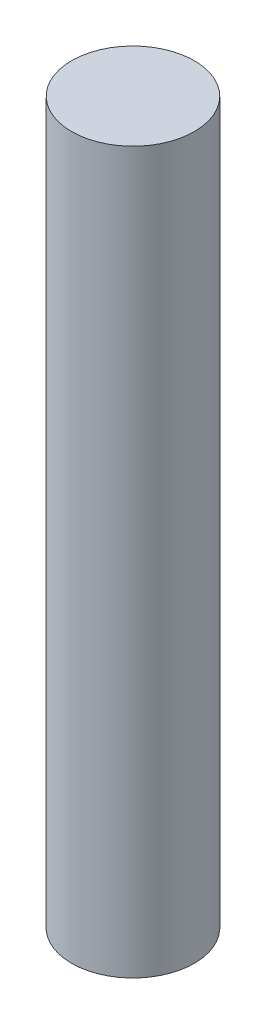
from build123d import *

# Parameters (mm, degrees)
SKETCH1_R           = 4.7625
BOSS_EXTRUDE1_DEPTH = 27.94


with BuildPart() as part:
    # Sketch1 → Boss-Extrude1 (new, symmetric)
    with BuildSketch(Plane(origin=(0, 0, 0), x_dir=(1, 0, 0), z_dir=(0, 1, 0))):
        with Locations(Location((0, 0, 0), (0, 0, 270))):
            Circle(SKETCH1_R)
    extrude(amount=BOSS_EXTRUDE1_DEPTH, both=True)


solid = part.part
